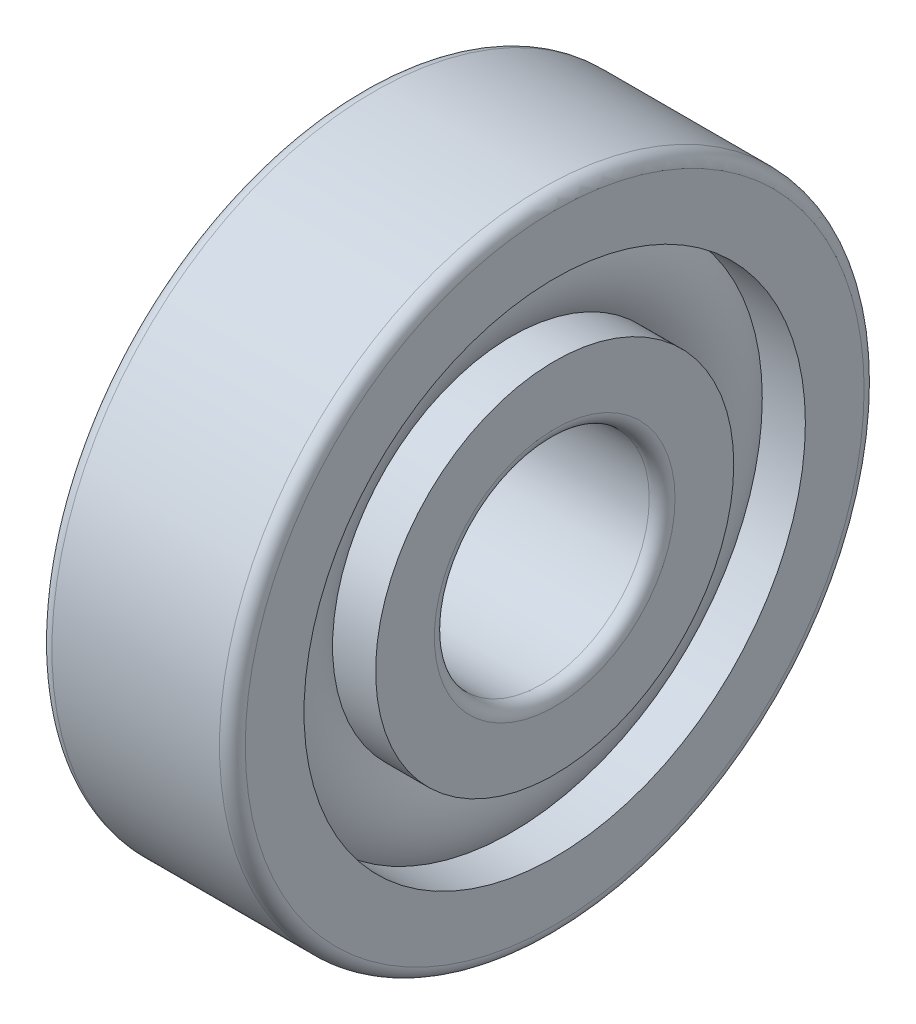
from build123d import *

# Parameters (mm, degrees)
ESQUISSE2_R = 2.85


with BuildPart() as part:
    # Esquisse1 → R_volution1 (revolve)
    with BuildSketch(Plane.XY, mode=Mode.PRIVATE) as r_volution1_sk:
        with BuildLine():
            Line((0, 14.4), (0, 11.666666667))
            Line((0, 11.666666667), (2.005561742, 11.666666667))
            ThreePointArc((2.005561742, 11.666666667), (1.5, 10), (2.005561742, 8.333333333))
            Line((2.005561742, 8.333333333), (0, 8.333333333))
            Line((0, 8.333333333), (0, 5.6))
            ThreePointArc((0, 5.6), (0.175735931, 5.175735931), (0.6, 5))
            Line((0.6, 5), (8.4, 5))
            ThreePointArc((8.4, 5), (8.824264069, 5.175735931), (9, 5.6))
            Line((9, 5.6), (9, 8.333333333))
            Line((9, 8.333333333), (6.994438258, 8.333333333))
            ThreePointArc((6.994438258, 8.333333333), (7.5, 10), (6.994438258, 11.666666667))
            Line((6.994438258, 11.666666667), (9, 11.666666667))
            Line((9, 11.666666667), (9, 14.4))
            ThreePointArc((9, 14.4), (8.824264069, 14.824264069), (8.4, 15))
            Line((8.4, 15), (0.6, 15))
            ThreePointArc((0.6, 15), (0.175735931, 14.824264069), (0, 14.4))
        make_face()
    revolve(r_volution1_sk.sketch.rotate(Axis((9, 0, 0), (-1, 0, 0)), 90), axis=Axis((9, 0, 0), (-1, 0, 0)))

    # Esquisse2 → Enl_vement de mati_re-R_volution1 (revolve, cut)
    with BuildSketch(Plane(origin=(0, 0, 0), x_dir=(1, 0, 0), z_dir=(0, 1, 0))):
        with Locations((4.5, 10)):
            Circle(ESQUISSE2_R)
    revolve(axis=Axis((9, 0, 0), (-1, 0, 0)), mode=Mode.SUBTRACT)


solid = part.part
